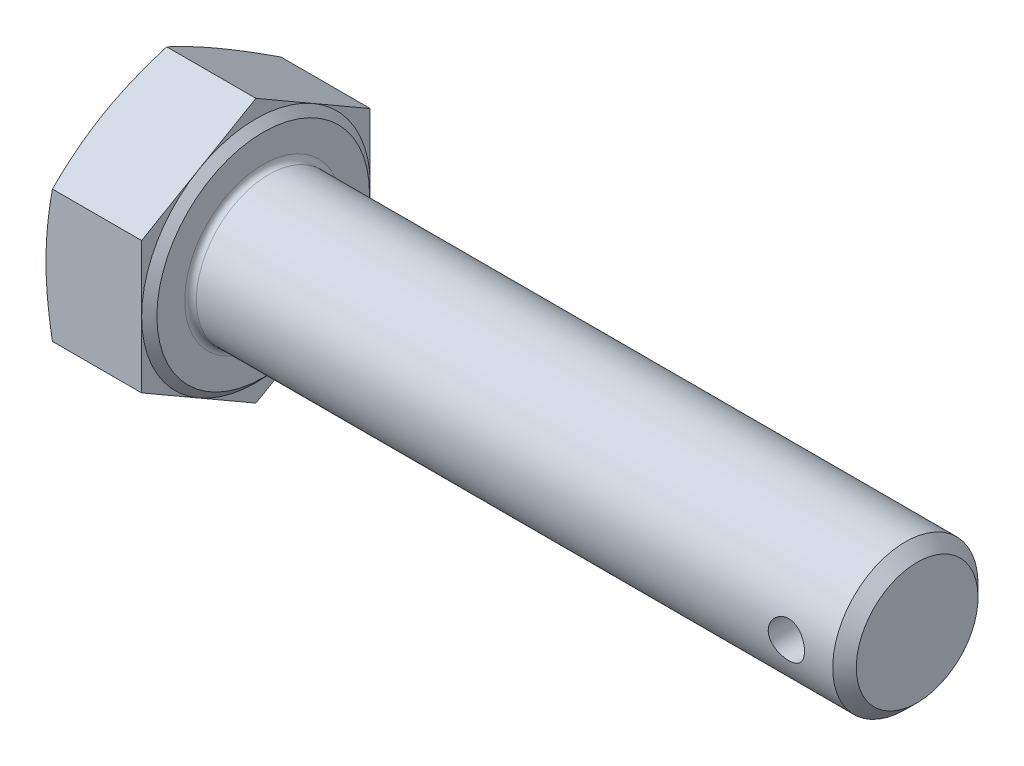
from build123d import *

# Parameters (mm, degrees)
BASEHEAD_DEPTH  = 6.58
SKETCH3_R       = 5
BASEBODY_DEPTH  = 45
CHAMFER1_SIZE   = 0.812
HEADFILLET_R    = 0.4
HOLE_DEPTH      = 54.447752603
HOLE_DEPTH_BACK = 54.447752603
SKETCH5_R       = 1.25


with BuildPart() as part:
    # Sketch-BaseHead → BaseHead (new body)
    with BuildSketch(Plane(origin=(0, 0, 0), x_dir=(0, 0, -1), z_dir=(1, 0, 0))):
        Polygon((0, -9.081719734), (7.865, -4.540859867), (7.865, 4.540859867), (0, 9.081719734), (-7.865, 4.540859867), (-7.865, -4.540859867), align=None)
    extrude(amount=BASEHEAD_DEPTH)

    # Sketch4 → HeadChamfer (revolve, cut)
    with BuildSketch(Plane(origin=(-0.264637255, -5.916896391, 0), x_dir=(0, 1, 0), z_dir=(0, 0, 1))):
        Polygon((14.998616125, -0.264637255), (13.781896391, -0.264637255), (14.998616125, -0.707487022), align=None)
    revolve(axis=Axis((-4.001564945, 0, 0), (1, 0, 0)), mode=Mode.SUBTRACT)

    # Sketch1 → Revolve1 (revolve)
    with BuildSketch(Plane(origin=(0, 0, 0), x_dir=(1, 0, 0), z_dir=(0, 1, 0)), mode=Mode.PRIVATE) as revolve1_sk:
        Polygon((6.58, 0), (7.08, 0), (7.08, 7.315), (6.58, 7.865), align=None)
    revolve(revolve1_sk.sketch.rotate(Axis((-4.001564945, 0, 0), (1, 0, 0)), 270), axis=Axis((-4.001564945, 0, 0), (1, 0, 0)))

    # Sketch3 → BaseBody (add)
    with BuildSketch(Plane(origin=(7.08, 0, 0), x_dir=(0, 0, -1), z_dir=(1, 0, 0))):
        with Locations(Location((0, 0, 0), (0, 0, 270))):
            Circle(SKETCH3_R)
    extrude(amount=BASEBODY_DEPTH)

    # Chamfer1
    chamfer1_edges = [part.edges().sort_by_distance(p)[0] for p in [
        (52.08, 5, 0),
    ]]
    chamfer(chamfer1_edges, length=CHAMFER1_SIZE)

    # HeadFillet
    headfillet_edges = [part.edges().sort_by_distance(p)[0] for p in [
        (7.08, 5, 0),
    ]]
    fillet(headfillet_edges, radius=HEADFILLET_R)

    # Sketch5 → Hole (cut, two sides: drawn at the far end of the back side and taken through both)
    with BuildSketch(Plane.XY.offset(-HOLE_DEPTH_BACK)):
        with Locations((48.08, 0)):
            Circle(SKETCH5_R)
    extrude(amount=HOLE_DEPTH + HOLE_DEPTH_BACK, mode=Mode.SUBTRACT)


solid = part.part
